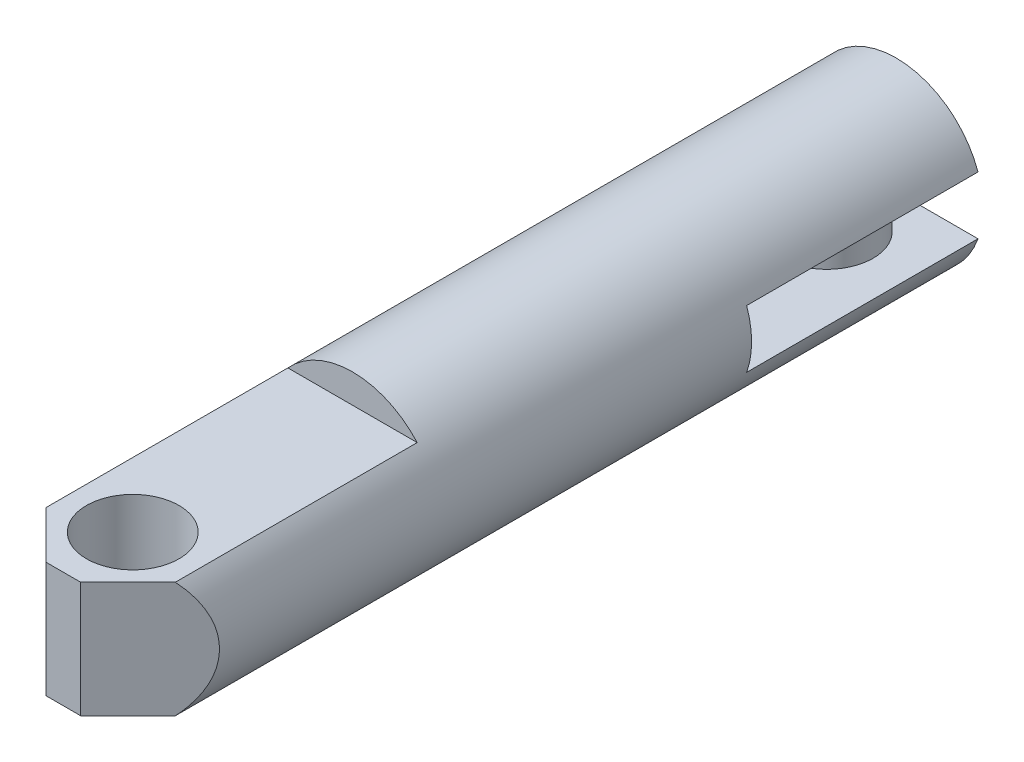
ISO-10303-21;
HEADER;
FILE_DESCRIPTION(('STEP AP214'),'2;1');
FILE_NAME('part.step','',(''),(''),'','','');
FILE_SCHEMA(('AUTOMOTIVE_DESIGN { 1 0 10303 214 1 1 1 1 }'));
ENDSEC;
DATA;
#1=APPLICATION_CONTEXT('core data for automotive mechanical design processes');
#2=APPLICATION_PROTOCOL_DEFINITION('international standard','automotive_design',2000,#1);
#3=PRODUCT_CONTEXT('',#1,'mechanical');
#4=PRODUCT('Part','Part','',(#3));
#5=PRODUCT_RELATED_PRODUCT_CATEGORY('part','',(#4));
#6=PRODUCT_DEFINITION_FORMATION('','',#4);
#7=PRODUCT_DEFINITION_CONTEXT('part definition',#1,'design');
#8=PRODUCT_DEFINITION('design','',#6,#7);
#9=PRODUCT_DEFINITION_SHAPE('','',#8);
#10=(LENGTH_UNIT() NAMED_UNIT(*) SI_UNIT(.MILLI.,.METRE.));
#11=(NAMED_UNIT(*) PLANE_ANGLE_UNIT() SI_UNIT($,.RADIAN.));
#12=(NAMED_UNIT(*) SI_UNIT($,.STERADIAN.) SOLID_ANGLE_UNIT());
#13=UNCERTAINTY_MEASURE_WITH_UNIT(LENGTH_MEASURE(1.E-05),#10,'distance_accuracy_value','');
#14=(GEOMETRIC_REPRESENTATION_CONTEXT(3) GLOBAL_UNCERTAINTY_ASSIGNED_CONTEXT((#13)) GLOBAL_UNIT_ASSIGNED_CONTEXT((#10,
#11,#12)) REPRESENTATION_CONTEXT('',''));
#15=CARTESIAN_POINT('',(0.,0.,0.));
#16=DIRECTION('',(0.,0.,1.));
#17=DIRECTION('',(1.,0.,0.));
#18=AXIS2_PLACEMENT_3D('',#15,#16,#17);
#19=CARTESIAN_POINT('',(7.5,2.5,20.));
#20=DIRECTION('',(0.,1.,0.));
#21=DIRECTION('',(0.,0.,1.));
#22=AXIS2_PLACEMENT_3D('',#19,#20,#21);
#23=PLANE('',#22);
#24=DIRECTION('',(1.,0.,0.));
#25=VECTOR('',#24,1.);
#26=CARTESIAN_POINT('',(7.5,2.5,20.));
#27=LINE('',#26,#25);
#28=CARTESIAN_POINT('',(-7.07106781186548,2.5,20.));
#29=VERTEX_POINT('',#28);
#30=CARTESIAN_POINT('',(7.07106781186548,2.5,20.));
#31=VERTEX_POINT('',#30);
#32=EDGE_CURVE('E196',#29,#31,#27,.T.);
#33=ORIENTED_EDGE('',*,*,#32,.F.);
#34=DIRECTION('',(0.,0.,-1.));
#35=VECTOR('',#34,1.);
#36=CARTESIAN_POINT('',(-7.07106781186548,2.5,72.));
#37=LINE('',#36,#35);
#38=CARTESIAN_POINT('',(-7.07106781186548,2.5,0.));
#39=VERTEX_POINT('',#38);
#40=EDGE_CURVE('E187',#39,#29,#37,.F.);
#41=ORIENTED_EDGE('',*,*,#40,.F.);
#42=DIRECTION('',(-1.,0.,0.));
#43=VECTOR('',#42,1.);
#44=CARTESIAN_POINT('',(0.,2.5,0.));
#45=LINE('',#44,#43);
#46=CARTESIAN_POINT('',(7.07106781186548,2.5,0.));
#47=VERTEX_POINT('',#46);
#48=EDGE_CURVE('E145',#47,#39,#45,.T.);
#49=ORIENTED_EDGE('',*,*,#48,.F.);
#50=DIRECTION('',(0.,0.,-1.));
#51=VECTOR('',#50,1.);
#52=CARTESIAN_POINT('',(7.07106781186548,2.5,72.));
#53=LINE('',#52,#51);
#54=EDGE_CURVE('E184',#31,#47,#53,.T.);
#55=ORIENTED_EDGE('',*,*,#54,.F.);
#56=EDGE_LOOP('',(#33,#41,#49,#55));
#57=FACE_BOUND('',#56,.T.);
#58=CARTESIAN_POINT('',(0.,2.5,5.99999999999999));
#59=DIRECTION('',(0.,1.,0.));
#60=DIRECTION('',(0.,0.,1.));
#61=AXIS2_PLACEMENT_3D('',#58,#59,#60);
#62=CIRCLE('',#61,4.);
#63=CARTESIAN_POINT('',(0.,2.5,9.99999999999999));
#64=VERTEX_POINT('',#63);
#65=EDGE_CURVE('E154',#64,#64,#62,.F.);
#66=ORIENTED_EDGE('',*,*,#65,.F.);
#67=EDGE_LOOP('',(#66));
#68=FACE_BOUND('',#67,.T.);
#69=ADVANCED_FACE('F28',(#57,#68),#23,.F.);
#70=CARTESIAN_POINT('',(7.5,-2.5,20.));
#71=DIRECTION('',(0.,-1.,0.));
#72=DIRECTION('',(0.,0.,-1.));
#73=AXIS2_PLACEMENT_3D('',#70,#71,#72);
#74=PLANE('',#73);
#75=DIRECTION('',(-1.,0.,0.));
#76=VECTOR('',#75,1.);
#77=CARTESIAN_POINT('',(7.5,-2.5,20.));
#78=LINE('',#77,#76);
#79=CARTESIAN_POINT('',(7.07106781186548,-2.5,20.));
#80=VERTEX_POINT('',#79);
#81=CARTESIAN_POINT('',(-7.07106781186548,-2.5,20.));
#82=VERTEX_POINT('',#81);
#83=EDGE_CURVE('E166',#80,#82,#78,.T.);
#84=ORIENTED_EDGE('',*,*,#83,.F.);
#85=DIRECTION('',(0.,0.,-1.));
#86=VECTOR('',#85,1.);
#87=CARTESIAN_POINT('',(7.07106781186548,-2.5,72.));
#88=LINE('',#87,#86);
#89=CARTESIAN_POINT('',(7.07106781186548,-2.5,0.));
#90=VERTEX_POINT('',#89);
#91=EDGE_CURVE('E193',#90,#80,#88,.F.);
#92=ORIENTED_EDGE('',*,*,#91,.F.);
#93=DIRECTION('',(1.,0.,0.));
#94=VECTOR('',#93,1.);
#95=CARTESIAN_POINT('',(0.,-2.5,0.));
#96=LINE('',#95,#94);
#97=CARTESIAN_POINT('',(-7.07106781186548,-2.5,0.));
#98=VERTEX_POINT('',#97);
#99=EDGE_CURVE('E137',#98,#90,#96,.T.);
#100=ORIENTED_EDGE('',*,*,#99,.F.);
#101=DIRECTION('',(0.,0.,-1.));
#102=VECTOR('',#101,1.);
#103=CARTESIAN_POINT('',(-7.07106781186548,-2.5,72.));
#104=LINE('',#103,#102);
#105=EDGE_CURVE('E190',#82,#98,#104,.T.);
#106=ORIENTED_EDGE('',*,*,#105,.F.);
#107=EDGE_LOOP('',(#84,#92,#100,#106));
#108=FACE_BOUND('',#107,.T.);
#109=CARTESIAN_POINT('',(0.,-2.5,5.99999999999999));
#110=DIRECTION('',(0.,-1.,0.));
#111=DIRECTION('',(0.,0.,-1.));
#112=AXIS2_PLACEMENT_3D('',#109,#110,#111);
#113=CIRCLE('',#112,4.);
#114=CARTESIAN_POINT('',(0.,-2.5,1.99999999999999));
#115=VERTEX_POINT('',#114);
#116=EDGE_CURVE('E151',#115,#115,#113,.F.);
#117=ORIENTED_EDGE('',*,*,#116,.F.);
#118=EDGE_LOOP('',(#117));
#119=FACE_BOUND('',#118,.T.);
#120=ADVANCED_FACE('F221',(#108,#119),#74,.F.);
#121=CARTESIAN_POINT('',(0.,0.,0.));
#122=DIRECTION('',(0.,0.,1.));
#123=DIRECTION('',(1.,0.,0.));
#124=AXIS2_PLACEMENT_3D('',#121,#122,#123);
#125=PLANE('',#124);
#126=CARTESIAN_POINT('',(0.,0.,0.));
#127=DIRECTION('',(0.,0.,1.));
#128=DIRECTION('',(1.,0.,0.));
#129=AXIS2_PLACEMENT_3D('',#126,#127,#128);
#130=CIRCLE('',#129,7.5);
#131=EDGE_CURVE('E123',#47,#39,#130,.T.);
#132=ORIENTED_EDGE('',*,*,#131,.F.);
#133=ORIENTED_EDGE('',*,*,#48,.T.);
#134=EDGE_LOOP('',(#132,#133));
#135=FACE_BOUND('',#134,.T.);
#136=ADVANCED_FACE('F228',(#135),#125,.F.);
#137=CARTESIAN_POINT('',(0.,0.,72.));
#138=DIRECTION('',(0.,0.,-1.));
#139=DIRECTION('',(-1.,0.,0.));
#140=AXIS2_PLACEMENT_3D('',#137,#138,#139);
#141=CYLINDRICAL_SURFACE('',#140,7.5);
#142=CARTESIAN_POINT('',(0.,0.,20.));
#143=DIRECTION('',(0.,0.,-1.));
#144=DIRECTION('',(-1.,0.,0.));
#145=AXIS2_PLACEMENT_3D('',#142,#143,#144);
#146=CIRCLE('',#145,7.5);
#147=EDGE_CURVE('E150',#31,#80,#146,.T.);
#148=ORIENTED_EDGE('',*,*,#147,.F.);
#149=ORIENTED_EDGE('',*,*,#54,.T.);
#150=ORIENTED_EDGE('',*,*,#131,.T.);
#151=ORIENTED_EDGE('',*,*,#40,.T.);
#152=EDGE_CURVE('E148',#82,#29,#146,.T.);
#153=ORIENTED_EDGE('',*,*,#152,.F.);
#154=ORIENTED_EDGE('',*,*,#105,.T.);
#155=EDGE_CURVE('E129',#98,#90,#130,.T.);
#156=ORIENTED_EDGE('',*,*,#155,.T.);
#157=ORIENTED_EDGE('',*,*,#91,.T.);
#158=EDGE_LOOP('',(#148,#149,#150,#151,#153,#154,#156,#157));
#159=FACE_BOUND('',#158,.T.);
#160=CARTESIAN_POINT('',(0.,0.,73.5));
#161=DIRECTION('',(0.707106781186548,0.,-0.707106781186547));
#162=DIRECTION('',(-0.707106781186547,0.,-0.707106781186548));
#163=AXIS2_PLACEMENT_3D('',#160,#161,#162);
#164=ELLIPSE('',#163,10.6066017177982,7.5);
#165=CARTESIAN_POINT('',(-5.59016994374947,-5.,67.9098300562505));
#166=VERTEX_POINT('',#165);
#167=CARTESIAN_POINT('',(-5.59016994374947,5.,67.9098300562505));
#168=VERTEX_POINT('',#167);
#169=EDGE_CURVE('E43',#166,#168,#164,.T.);
#170=ORIENTED_EDGE('',*,*,#169,.T.);
#171=DIRECTION('',(0.,0.,-1.));
#172=VECTOR('',#171,1.);
#173=CARTESIAN_POINT('',(-5.59016994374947,5.,72.));
#174=LINE('',#173,#172);
#175=CARTESIAN_POINT('',(-5.59016994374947,5.,47.));
#176=VERTEX_POINT('',#175);
#177=EDGE_CURVE('E119',#168,#176,#174,.T.);
#178=ORIENTED_EDGE('',*,*,#177,.T.);
#179=CARTESIAN_POINT('',(0.,0.,47.));
#180=DIRECTION('',(0.,0.,1.));
#181=DIRECTION('',(1.,0.,0.));
#182=AXIS2_PLACEMENT_3D('',#179,#180,#181);
#183=CIRCLE('',#182,7.5);
#184=CARTESIAN_POINT('',(5.59016994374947,5.,47.));
#185=VERTEX_POINT('',#184);
#186=EDGE_CURVE('E122',#185,#176,#183,.T.);
#187=ORIENTED_EDGE('',*,*,#186,.F.);
#188=DIRECTION('',(0.,0.,-1.));
#189=VECTOR('',#188,1.);
#190=CARTESIAN_POINT('',(5.59016994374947,5.,72.));
#191=LINE('',#190,#189);
#192=CARTESIAN_POINT('',(5.59016994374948,5.,67.9098300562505));
#193=VERTEX_POINT('',#192);
#194=EDGE_CURVE('E169',#185,#193,#191,.F.);
#195=ORIENTED_EDGE('',*,*,#194,.T.);
#196=CARTESIAN_POINT('',(0.,0.,73.5));
#197=DIRECTION('',(-0.707106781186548,0.,-0.707106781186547));
#198=DIRECTION('',(0.707106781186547,0.,-0.707106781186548));
#199=AXIS2_PLACEMENT_3D('',#196,#197,#198);
#200=ELLIPSE('',#199,10.6066017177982,7.5);
#201=CARTESIAN_POINT('',(5.59016994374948,-5.,67.9098300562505));
#202=VERTEX_POINT('',#201);
#203=EDGE_CURVE('E162',#193,#202,#200,.T.);
#204=ORIENTED_EDGE('',*,*,#203,.T.);
#205=DIRECTION('',(0.,0.,-1.));
#206=VECTOR('',#205,1.);
#207=CARTESIAN_POINT('',(5.59016994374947,-5.,72.));
#208=LINE('',#207,#206);
#209=CARTESIAN_POINT('',(5.59016994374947,-5.,47.));
#210=VERTEX_POINT('',#209);
#211=EDGE_CURVE('E160',#202,#210,#208,.T.);
#212=ORIENTED_EDGE('',*,*,#211,.T.);
#213=CARTESIAN_POINT('',(0.,0.,47.));
#214=DIRECTION('',(0.,0.,1.));
#215=DIRECTION('',(1.,0.,0.));
#216=AXIS2_PLACEMENT_3D('',#213,#214,#215);
#217=CIRCLE('',#216,7.5);
#218=CARTESIAN_POINT('',(-5.59016994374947,-5.,47.));
#219=VERTEX_POINT('',#218);
#220=EDGE_CURVE('E134',#219,#210,#217,.T.);
#221=ORIENTED_EDGE('',*,*,#220,.F.);
#222=DIRECTION('',(0.,0.,-1.));
#223=VECTOR('',#222,1.);
#224=CARTESIAN_POINT('',(-5.59016994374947,-5.,72.));
#225=LINE('',#224,#223);
#226=EDGE_CURVE('E177',#219,#166,#225,.F.);
#227=ORIENTED_EDGE('',*,*,#226,.T.);
#228=EDGE_LOOP('',(#170,#178,#187,#195,#204,#212,#221,#227));
#229=FACE_BOUND('',#228,.T.);
#230=ADVANCED_FACE('F30',(#159,#229),#141,.T.);
#231=CARTESIAN_POINT('',(0.,0.,72.));
#232=DIRECTION('',(0.,0.,1.));
#233=DIRECTION('',(1.,0.,0.));
#234=AXIS2_PLACEMENT_3D('',#231,#232,#233);
#235=PLANE('',#234);
#236=DIRECTION('',(0.,1.,0.));
#237=VECTOR('',#236,1.);
#238=CARTESIAN_POINT('',(-1.5,-7.5,72.));
#239=LINE('',#238,#237);
#240=CARTESIAN_POINT('',(-1.5,-5.,72.));
#241=VERTEX_POINT('',#240);
#242=CARTESIAN_POINT('',(-1.5,5.,72.));
#243=VERTEX_POINT('',#242);
#244=EDGE_CURVE('E104',#241,#243,#239,.T.);
#245=ORIENTED_EDGE('',*,*,#244,.F.);
#246=DIRECTION('',(-1.,0.,0.));
#247=VECTOR('',#246,1.);
#248=CARTESIAN_POINT('',(0.,-5.,72.));
#249=LINE('',#248,#247);
#250=CARTESIAN_POINT('',(1.49999999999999,-5.,72.));
#251=VERTEX_POINT('',#250);
#252=EDGE_CURVE('E126',#251,#241,#249,.T.);
#253=ORIENTED_EDGE('',*,*,#252,.F.);
#254=DIRECTION('',(0.,1.,0.));
#255=VECTOR('',#254,1.);
#256=CARTESIAN_POINT('',(1.5,-7.5,72.));
#257=LINE('',#256,#255);
#258=CARTESIAN_POINT('',(1.5,5.,72.));
#259=VERTEX_POINT('',#258);
#260=EDGE_CURVE('E50',#251,#259,#257,.T.);
#261=ORIENTED_EDGE('',*,*,#260,.T.);
#262=DIRECTION('',(1.,0.,0.));
#263=VECTOR('',#262,1.);
#264=CARTESIAN_POINT('',(0.,5.,72.));
#265=LINE('',#264,#263);
#266=EDGE_CURVE('E117',#243,#259,#265,.T.);
#267=ORIENTED_EDGE('',*,*,#266,.F.);
#268=EDGE_LOOP('',(#245,#253,#261,#267));
#269=FACE_BOUND('',#268,.T.);
#270=ADVANCED_FACE('F121',(#269),#235,.T.);
#271=ORIENTED_EDGE('',*,*,#155,.F.);
#272=ORIENTED_EDGE('',*,*,#99,.T.);
#273=EDGE_LOOP('',(#271,#272));
#274=FACE_BOUND('',#273,.T.);
#275=ADVANCED_FACE('F257',(#274),#125,.F.);
#276=CARTESIAN_POINT('',(-7.5,5.,47.));
#277=DIRECTION('',(0.,0.,1.));
#278=DIRECTION('',(1.,0.,0.));
#279=AXIS2_PLACEMENT_3D('',#276,#277,#278);
#280=PLANE('',#279);
#281=DIRECTION('',(1.,0.,0.));
#282=VECTOR('',#281,1.);
#283=CARTESIAN_POINT('',(-7.5,5.,47.));
#284=LINE('',#283,#282);
#285=EDGE_CURVE('E172',#176,#185,#284,.T.);
#286=ORIENTED_EDGE('',*,*,#285,.T.);
#287=ORIENTED_EDGE('',*,*,#186,.T.);
#288=EDGE_LOOP('',(#286,#287));
#289=FACE_BOUND('',#288,.T.);
#290=ADVANCED_FACE('F216',(#289),#280,.T.);
#291=CARTESIAN_POINT('',(-7.5,5.,47.));
#292=DIRECTION('',(0.,-1.,0.));
#293=DIRECTION('',(0.,0.,-1.));
#294=AXIS2_PLACEMENT_3D('',#291,#292,#293);
#295=PLANE('',#294);
#296=CARTESIAN_POINT('',(0.,5.,66.));
#297=DIRECTION('',(0.,1.,0.));
#298=DIRECTION('',(0.,0.,1.));
#299=AXIS2_PLACEMENT_3D('',#296,#297,#298);
#300=CIRCLE('',#299,4.00000000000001);
#301=CARTESIAN_POINT('',(0.,5.,70.));
#302=VERTEX_POINT('',#301);
#303=EDGE_CURVE('E142',#302,#302,#300,.T.);
#304=ORIENTED_EDGE('',*,*,#303,.F.);
#305=EDGE_LOOP('',(#304));
#306=FACE_BOUND('',#305,.T.);
#307=ORIENTED_EDGE('',*,*,#177,.F.);
#308=DIRECTION('',(-0.707106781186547,0.,-0.707106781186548));
#309=VECTOR('',#308,1.);
#310=CARTESIAN_POINT('',(-1.5,5.,72.));
#311=LINE('',#310,#309);
#312=EDGE_CURVE('E107',#243,#168,#311,.T.);
#313=ORIENTED_EDGE('',*,*,#312,.F.);
#314=ORIENTED_EDGE('',*,*,#266,.T.);
#315=DIRECTION('',(-0.707106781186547,0.,0.707106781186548));
#316=VECTOR('',#315,1.);
#317=CARTESIAN_POINT('',(1.5,5.,72.));
#318=LINE('',#317,#316);
#319=EDGE_CURVE('E163',#193,#259,#318,.T.);
#320=ORIENTED_EDGE('',*,*,#319,.F.);
#321=ORIENTED_EDGE('',*,*,#194,.F.);
#322=ORIENTED_EDGE('',*,*,#285,.F.);
#323=EDGE_LOOP('',(#307,#313,#314,#320,#321,#322));
#324=FACE_BOUND('',#323,.T.);
#325=ADVANCED_FACE('F115',(#306,#324),#295,.F.);
#326=CARTESIAN_POINT('',(7.5,-7.5,47.));
#327=DIRECTION('',(0.,0.,1.));
#328=DIRECTION('',(1.,0.,0.));
#329=AXIS2_PLACEMENT_3D('',#326,#327,#328);
#330=PLANE('',#329);
#331=DIRECTION('',(-1.,0.,0.));
#332=VECTOR('',#331,1.);
#333=CARTESIAN_POINT('',(-7.5,-5.,47.));
#334=LINE('',#333,#332);
#335=EDGE_CURVE('E141',#210,#219,#334,.T.);
#336=ORIENTED_EDGE('',*,*,#335,.T.);
#337=ORIENTED_EDGE('',*,*,#220,.T.);
#338=EDGE_LOOP('',(#336,#337));
#339=FACE_BOUND('',#338,.T.);
#340=ADVANCED_FACE('F204',(#339),#330,.T.);
#341=CARTESIAN_POINT('',(-7.5,-5.,47.));
#342=DIRECTION('',(0.,1.,0.));
#343=DIRECTION('',(0.,0.,1.));
#344=AXIS2_PLACEMENT_3D('',#341,#342,#343);
#345=PLANE('',#344);
#346=CARTESIAN_POINT('',(0.,-5.,66.));
#347=DIRECTION('',(0.,1.,0.));
#348=DIRECTION('',(0.,0.,1.));
#349=AXIS2_PLACEMENT_3D('',#346,#347,#348);
#350=CIRCLE('',#349,4.00000000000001);
#351=CARTESIAN_POINT('',(0.,-5.,70.));
#352=VERTEX_POINT('',#351);
#353=EDGE_CURVE('E138',#352,#352,#350,.T.);
#354=ORIENTED_EDGE('',*,*,#353,.T.);
#355=EDGE_LOOP('',(#354));
#356=FACE_BOUND('',#355,.T.);
#357=ORIENTED_EDGE('',*,*,#252,.T.);
#358=DIRECTION('',(-0.707106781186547,0.,-0.707106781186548));
#359=VECTOR('',#358,1.);
#360=CARTESIAN_POINT('',(-17.,-5.,56.5));
#361=LINE('',#360,#359);
#362=EDGE_CURVE('E11',#241,#166,#361,.T.);
#363=ORIENTED_EDGE('',*,*,#362,.T.);
#364=ORIENTED_EDGE('',*,*,#226,.F.);
#365=ORIENTED_EDGE('',*,*,#335,.F.);
#366=ORIENTED_EDGE('',*,*,#211,.F.);
#367=DIRECTION('',(-0.707106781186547,0.,0.707106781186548));
#368=VECTOR('',#367,1.);
#369=CARTESIAN_POINT('',(9.50000000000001,-5.,64.));
#370=LINE('',#369,#368);
#371=EDGE_CURVE('E36',#202,#251,#370,.T.);
#372=ORIENTED_EDGE('',*,*,#371,.T.);
#373=EDGE_LOOP('',(#357,#363,#364,#365,#366,#372));
#374=FACE_BOUND('',#373,.T.);
#375=ADVANCED_FACE('F158',(#356,#374),#345,.F.);
#376=CARTESIAN_POINT('',(0.,-7.5,66.));
#377=DIRECTION('',(0.,1.,0.));
#378=DIRECTION('',(0.,0.,1.));
#379=AXIS2_PLACEMENT_3D('',#376,#377,#378);
#380=CYLINDRICAL_SURFACE('',#379,4.00000000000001);
#381=ORIENTED_EDGE('',*,*,#303,.T.);
#382=EDGE_LOOP('',(#381));
#383=FACE_BOUND('',#382,.T.);
#384=ORIENTED_EDGE('',*,*,#353,.F.);
#385=EDGE_LOOP('',(#384));
#386=FACE_BOUND('',#385,.T.);
#387=ADVANCED_FACE('F212',(#383,#386),#380,.F.);
#388=CARTESIAN_POINT('',(7.5,-2.5,20.));
#389=DIRECTION('',(0.,0.,-1.));
#390=DIRECTION('',(-1.,0.,0.));
#391=AXIS2_PLACEMENT_3D('',#388,#389,#390);
#392=PLANE('',#391);
#393=ORIENTED_EDGE('',*,*,#32,.T.);
#394=ORIENTED_EDGE('',*,*,#147,.T.);
#395=ORIENTED_EDGE('',*,*,#83,.T.);
#396=ORIENTED_EDGE('',*,*,#152,.T.);
#397=EDGE_LOOP('',(#393,#394,#395,#396));
#398=FACE_BOUND('',#397,.T.);
#399=ADVANCED_FACE('F234',(#398),#392,.T.);
#400=CARTESIAN_POINT('',(0.,7.501,5.99999999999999));
#401=DIRECTION('',(0.,-1.,0.));
#402=DIRECTION('',(0.,0.,-1.));
#403=AXIS2_PLACEMENT_3D('',#400,#401,#402);
#404=CYLINDRICAL_SURFACE('',#403,4.);
#405=ORIENTED_EDGE('',*,*,#116,.T.);
#406=EDGE_LOOP('',(#405));
#407=FACE_BOUND('',#406,.T.);
#408=ORIENTED_EDGE('',*,*,#65,.T.);
#409=EDGE_LOOP('',(#408));
#410=FACE_BOUND('',#409,.T.);
#411=ADVANCED_FACE('F240',(#407,#410),#404,.T.);
#412=CARTESIAN_POINT('',(1.5,-7.5,72.));
#413=DIRECTION('',(-0.707106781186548,0.,-0.707106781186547));
#414=DIRECTION('',(-0.707106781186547,0.,0.707106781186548));
#415=AXIS2_PLACEMENT_3D('',#412,#413,#414);
#416=PLANE('',#415);
#417=ORIENTED_EDGE('',*,*,#319,.T.);
#418=ORIENTED_EDGE('',*,*,#260,.F.);
#419=ORIENTED_EDGE('',*,*,#371,.F.);
#420=ORIENTED_EDGE('',*,*,#203,.F.);
#421=EDGE_LOOP('',(#417,#418,#419,#420));
#422=FACE_BOUND('',#421,.T.);
#423=ADVANCED_FACE('F161',(#422),#416,.F.);
#424=CARTESIAN_POINT('',(-1.5,-7.5,72.));
#425=DIRECTION('',(0.707106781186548,0.,-0.707106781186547));
#426=DIRECTION('',(-0.707106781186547,0.,-0.707106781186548));
#427=AXIS2_PLACEMENT_3D('',#424,#425,#426);
#428=PLANE('',#427);
#429=ORIENTED_EDGE('',*,*,#169,.F.);
#430=ORIENTED_EDGE('',*,*,#362,.F.);
#431=ORIENTED_EDGE('',*,*,#244,.T.);
#432=ORIENTED_EDGE('',*,*,#312,.T.);
#433=EDGE_LOOP('',(#429,#430,#431,#432));
#434=FACE_BOUND('',#433,.T.);
#435=ADVANCED_FACE('F106',(#434),#428,.F.);
#436=CLOSED_SHELL('',(#69,#120,#136,#230,#270,#275,#290,#325,#340,#375,#387,#399,#411,#423,#435));
#437=MANIFOLD_SOLID_BREP('B2',#436);
#438=ADVANCED_BREP_SHAPE_REPRESENTATION('',(#18,#437),#14);
#439=SHAPE_DEFINITION_REPRESENTATION(#9,#438);
ENDSEC;
END-ISO-10303-21;
